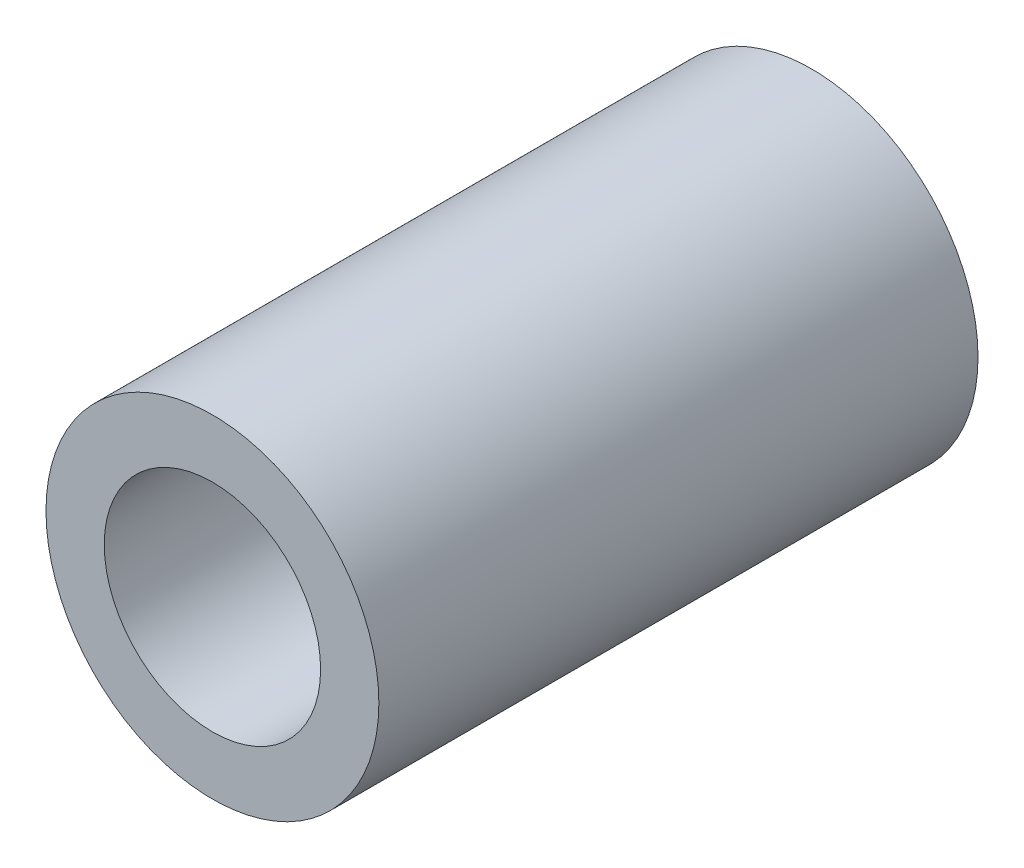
from build123d import *

# Parameters (mm, degrees)
SKETCH_1_R      = 5
SKETCH_1_R_2    = 3.25
EXTRUDE_1_DEPTH = 18


with BuildPart() as part:
    # Sketch 1 → Extrude 1 (new body)
    with BuildSketch(Plane.XY):
        Circle(SKETCH_1_R)
        Circle(SKETCH_1_R_2, mode=Mode.SUBTRACT)
    extrude(amount=EXTRUDE_1_DEPTH)


solid = part.part
